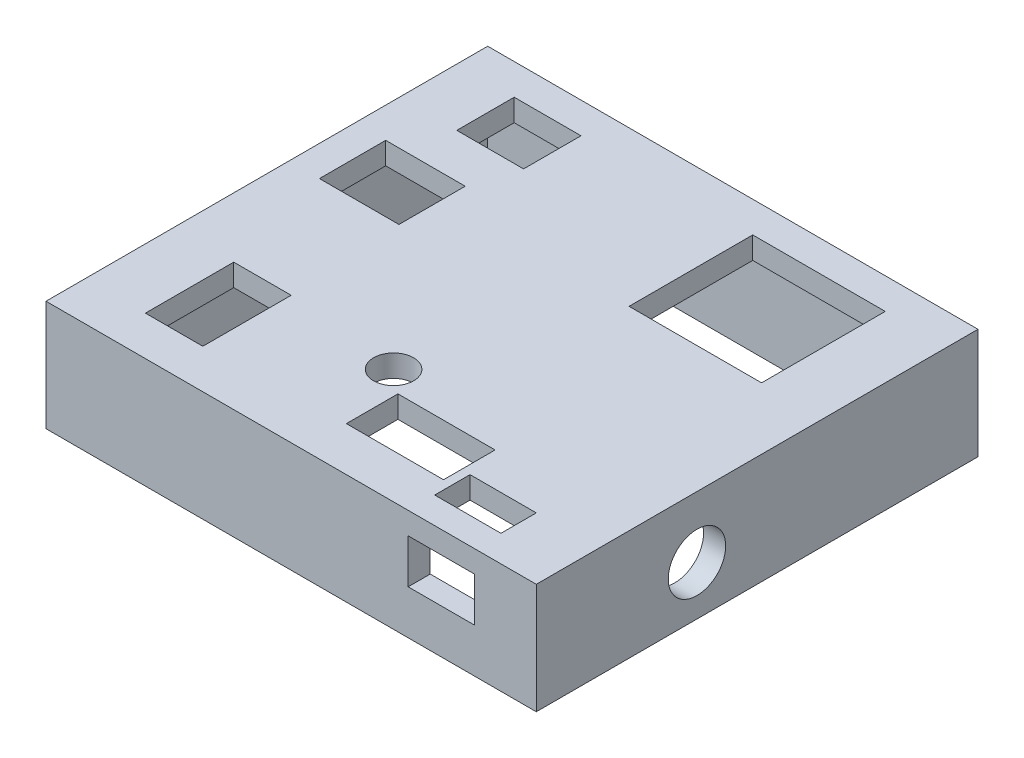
from build123d import *

# Parameters (mm, degrees)
SKETCH1_W           = 111
SKETCH1_H           = 100
BOSS_EXTRUDE1_DEPTH = 25
SKETCH2_W           = 101
SKETCH2_H           = 90
CUT_EXTRUDE1_DEPTH  = 20
SKETCH3_W           = 22
SKETCH3_H           = 11.672445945
CUT_EXTRUDE2_DEPTH  = 20
SKETCH4_W           = 15
SKETCH4_H           = 8
CUT_EXTRUDE3_DEPTH  = 20
SKETCH5_W           = 18
SKETCH5_H           = 15
CUT_EXTRUDE4_DEPTH  = 20
SKETCH6_W           = 15.121270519
SKETCH6_H           = 13
CUT_EXTRUDE5_DEPTH  = 20
SKETCH7_W           = 30
SKETCH7_H           = 28
CUT_EXTRUDE6_DEPTH  = 20
SKETCH8_R           = 4.533684
CUT_EXTRUDE7_DEPTH  = 20
SKETCH9_W           = 13
SKETCH9_H           = 20
CUT_EXTRUDE8_DEPTH  = 20
SKETCH10_R          = 6.5
CUT_EXTRUDE10_DEPTH = 20
SKETCH11_W          = 15.022741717
SKETCH11_H          = 10
CUT_EXTRUDE11_DEPTH = 20


with BuildPart() as part:
    # Sketch1 → Boss-Extrude1 (new body)
    with BuildSketch(Plane(origin=(0, 0, 0), x_dir=(1, 0, 0), z_dir=(0, 1, 0))):
        with Locations((-42.348341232, -8.130331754)):
            Rectangle(SKETCH1_W, SKETCH1_H)
    extrude(amount=BOSS_EXTRUDE1_DEPTH)

    # Sketch2 → Cut-Extrude1 (cut)
    with BuildSketch(Plane.XZ):
        with Locations((-42.348341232, 8.130331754)):
            Rectangle(SKETCH2_W, SKETCH2_H)
    extrude(amount=-CUT_EXTRUDE1_DEPTH, mode=Mode.SUBTRACT)

    # Sketch3 → Cut-Extrude2 (cut)
    with BuildSketch(Plane.XZ.offset(-20)):
        with Locations((-28.848341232, 42.294108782)):
            Rectangle(SKETCH3_W, SKETCH3_H)
    extrude(amount=-CUT_EXTRUDE2_DEPTH, mode=Mode.SUBTRACT)

    # Sketch4 → Cut-Extrude3 (cut)
    with BuildSketch(Plane.XZ.offset(-20)):
        with Locations((-8.348341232, 48.130331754)):
            Rectangle(SKETCH4_W, SKETCH4_H)
    extrude(amount=-CUT_EXTRUDE3_DEPTH, mode=Mode.SUBTRACT)

    # Sketch5 → Cut-Extrude4 (cut)
    with BuildSketch(Plane(origin=(0, 20, 0), x_dir=(-1, 0, 0), z_dir=(0, -1, 0))):
        with Locations((81.940531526, 4.369668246)):
            Rectangle(SKETCH5_W, SKETCH5_H)
    extrude(amount=-CUT_EXTRUDE4_DEPTH, mode=Mode.SUBTRACT)

    # Sketch6 → Cut-Extrude5 (cut)
    with BuildSketch(Plane.XZ.offset(-20)):
        with Locations((-77.287705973, -28.369668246)):
            Rectangle(SKETCH6_W, SKETCH6_H)
    extrude(amount=-CUT_EXTRUDE5_DEPTH, mode=Mode.SUBTRACT)

    # Sketch7 → Cut-Extrude6 (cut)
    with BuildSketch(Plane(origin=(0, 20, 0), x_dir=(-1, 0, 0), z_dir=(0, -1, 0))):
        with Locations((15.848341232, 20.869668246)):
            Rectangle(SKETCH7_W, SKETCH7_H)
    extrude(amount=-CUT_EXTRUDE6_DEPTH, mode=Mode.SUBTRACT)

    # Sketch8 → Cut-Extrude7 (cut)
    with BuildSketch(Plane.XZ.offset(-20)):
        with Locations(Location((-45.155747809, 32.130331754, 0), (0, 0, 270))):
            Circle(SKETCH8_R)
    extrude(amount=-CUT_EXTRUDE7_DEPTH, mode=Mode.SUBTRACT)

    # Sketch9 → Cut-Extrude8 (cut)
    with BuildSketch(Plane.XZ.offset(-20)):
        with Locations((-77.761287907, 39.214530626)):
            Rectangle(SKETCH9_W, SKETCH9_H)
    extrude(amount=-CUT_EXTRUDE8_DEPTH, mode=Mode.SUBTRACT)

    # Sketch10 → Cut-Extrude10 (cut)
    with BuildSketch(Plane(origin=(13.151658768, 0, 0), x_dir=(0, 0, -1), z_dir=(1, 0, 0))):
        with Locations((-21.758345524, 11.101496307)):
            Circle(SKETCH10_R)
    extrude(amount=-CUT_EXTRUDE10_DEPTH, mode=Mode.SUBTRACT)

    # Sketch11 → Cut-Extrude11 (cut)
    with BuildSketch(Plane(origin=(0, 0, 53.130331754), x_dir=(-1, 0, 0), z_dir=(0, 0, -1))):
        with Locations((8.34551656, 15)):
            Rectangle(SKETCH11_W, SKETCH11_H)
    extrude(amount=-CUT_EXTRUDE11_DEPTH, mode=Mode.SUBTRACT)


solid = part.part
